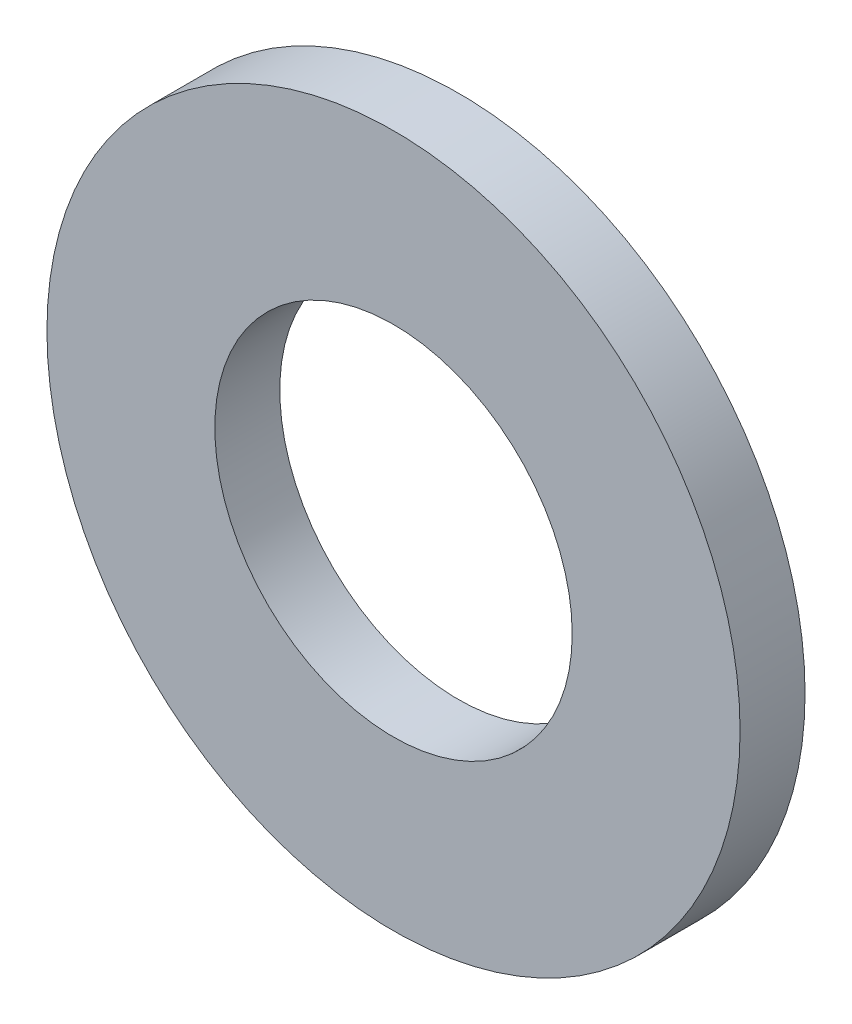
ISO-10303-21;
HEADER;
FILE_DESCRIPTION(('STEP AP214'),'2;1');
FILE_NAME('part.step','',(''),(''),'','','');
FILE_SCHEMA(('AUTOMOTIVE_DESIGN { 1 0 10303 214 1 1 1 1 }'));
ENDSEC;
DATA;
#1=APPLICATION_CONTEXT('core data for automotive mechanical design processes');
#2=APPLICATION_PROTOCOL_DEFINITION('international standard','automotive_design',2000,#1);
#3=PRODUCT_CONTEXT('',#1,'mechanical');
#4=PRODUCT('Part','Part','',(#3));
#5=PRODUCT_RELATED_PRODUCT_CATEGORY('part','',(#4));
#6=PRODUCT_DEFINITION_FORMATION('','',#4);
#7=PRODUCT_DEFINITION_CONTEXT('part definition',#1,'design');
#8=PRODUCT_DEFINITION('design','',#6,#7);
#9=PRODUCT_DEFINITION_SHAPE('','',#8);
#10=(LENGTH_UNIT() NAMED_UNIT(*) SI_UNIT(.MILLI.,.METRE.));
#11=(NAMED_UNIT(*) PLANE_ANGLE_UNIT() SI_UNIT($,.RADIAN.));
#12=(NAMED_UNIT(*) SI_UNIT($,.STERADIAN.) SOLID_ANGLE_UNIT());
#13=UNCERTAINTY_MEASURE_WITH_UNIT(LENGTH_MEASURE(1.E-05),#10,'distance_accuracy_value','');
#14=(GEOMETRIC_REPRESENTATION_CONTEXT(3) GLOBAL_UNCERTAINTY_ASSIGNED_CONTEXT((#13)) GLOBAL_UNIT_ASSIGNED_CONTEXT((#10,
#11,#12)) REPRESENTATION_CONTEXT('',''));
#15=CARTESIAN_POINT('',(0.,0.,0.));
#16=DIRECTION('',(0.,0.,1.));
#17=DIRECTION('',(1.,0.,0.));
#18=AXIS2_PLACEMENT_3D('',#15,#16,#17);
#19=CARTESIAN_POINT('',(0.,0.,1.4999999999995));
#20=DIRECTION('',(0.,0.,1.));
#21=DIRECTION('',(1.,0.,0.));
#22=AXIS2_PLACEMENT_3D('',#19,#20,#21);
#23=PLANE('',#22);
#24=CARTESIAN_POINT('',(0.,0.,1.4999999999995));
#25=DIRECTION('',(0.,0.,1.));
#26=DIRECTION('',(1.,0.,0.));
#27=AXIS2_PLACEMENT_3D('',#24,#25,#26);
#28=CIRCLE('',#27,8.);
#29=CARTESIAN_POINT('',(8.,0.,1.4999999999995));
#30=VERTEX_POINT('',#29);
#31=EDGE_CURVE('E10',#30,#30,#28,.T.);
#32=ORIENTED_EDGE('',*,*,#31,.T.);
#33=EDGE_LOOP('',(#32));
#34=FACE_BOUND('',#33,.T.);
#35=CARTESIAN_POINT('',(0.,0.,1.4999999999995));
#36=DIRECTION('',(0.,0.,1.));
#37=DIRECTION('',(1.,0.,0.));
#38=AXIS2_PLACEMENT_3D('',#35,#36,#37);
#39=CIRCLE('',#38,4.125);
#40=CARTESIAN_POINT('',(4.125,0.,1.4999999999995));
#41=VERTEX_POINT('',#40);
#42=EDGE_CURVE('E25',#41,#41,#39,.T.);
#43=ORIENTED_EDGE('',*,*,#42,.F.);
#44=EDGE_LOOP('',(#43));
#45=FACE_BOUND('',#44,.T.);
#46=ADVANCED_FACE('F14',(#34,#45),#23,.T.);
#47=CARTESIAN_POINT('',(0.,0.,-4.9960036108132E-13));
#48=DIRECTION('',(0.,0.,1.));
#49=DIRECTION('',(1.,0.,0.));
#50=AXIS2_PLACEMENT_3D('',#47,#48,#49);
#51=PLANE('',#50);
#52=CARTESIAN_POINT('',(0.,0.,-4.9960036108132E-13));
#53=DIRECTION('',(0.,0.,1.));
#54=DIRECTION('',(1.,0.,0.));
#55=AXIS2_PLACEMENT_3D('',#52,#53,#54);
#56=CIRCLE('',#55,8.);
#57=CARTESIAN_POINT('',(8.,0.,-5.01604231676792E-13));
#58=VERTEX_POINT('',#57);
#59=EDGE_CURVE('E18',#58,#58,#56,.T.);
#60=ORIENTED_EDGE('',*,*,#59,.F.);
#61=EDGE_LOOP('',(#60));
#62=FACE_BOUND('',#61,.T.);
#63=CARTESIAN_POINT('',(0.,0.,-4.9960036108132E-13));
#64=DIRECTION('',(0.,0.,1.));
#65=DIRECTION('',(1.,0.,0.));
#66=AXIS2_PLACEMENT_3D('',#63,#64,#65);
#67=CIRCLE('',#66,4.125);
#68=CARTESIAN_POINT('',(4.125,0.,-5.0063360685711E-13));
#69=VERTEX_POINT('',#68);
#70=EDGE_CURVE('E27',#69,#69,#67,.T.);
#71=ORIENTED_EDGE('',*,*,#70,.T.);
#72=EDGE_LOOP('',(#71));
#73=FACE_BOUND('',#72,.T.);
#74=ADVANCED_FACE('F37',(#62,#73),#51,.F.);
#75=CARTESIAN_POINT('',(0.,0.,1.4999999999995));
#76=DIRECTION('',(0.,0.,-1.));
#77=DIRECTION('',(-1.,0.,0.));
#78=AXIS2_PLACEMENT_3D('',#75,#76,#77);
#79=CYLINDRICAL_SURFACE('',#78,8.);
#80=ORIENTED_EDGE('',*,*,#31,.F.);
#81=EDGE_LOOP('',(#80));
#82=FACE_BOUND('',#81,.T.);
#83=ORIENTED_EDGE('',*,*,#59,.T.);
#84=EDGE_LOOP('',(#83));
#85=FACE_BOUND('',#84,.T.);
#86=ADVANCED_FACE('F16',(#82,#85),#79,.T.);
#87=CARTESIAN_POINT('',(0.,0.,1.4999999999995));
#88=DIRECTION('',(0.,0.,-1.));
#89=DIRECTION('',(-1.,0.,0.));
#90=AXIS2_PLACEMENT_3D('',#87,#88,#89);
#91=CYLINDRICAL_SURFACE('',#90,4.125);
#92=ORIENTED_EDGE('',*,*,#42,.T.);
#93=EDGE_LOOP('',(#92));
#94=FACE_BOUND('',#93,.T.);
#95=ORIENTED_EDGE('',*,*,#70,.F.);
#96=EDGE_LOOP('',(#95));
#97=FACE_BOUND('',#96,.T.);
#98=ADVANCED_FACE('F33',(#94,#97),#91,.F.);
#99=CLOSED_SHELL('',(#46,#74,#86,#98));
#100=MANIFOLD_SOLID_BREP('B1',#99);
#101=ADVANCED_BREP_SHAPE_REPRESENTATION('',(#18,#100),#14);
#102=SHAPE_DEFINITION_REPRESENTATION(#9,#101);
ENDSEC;
END-ISO-10303-21;
